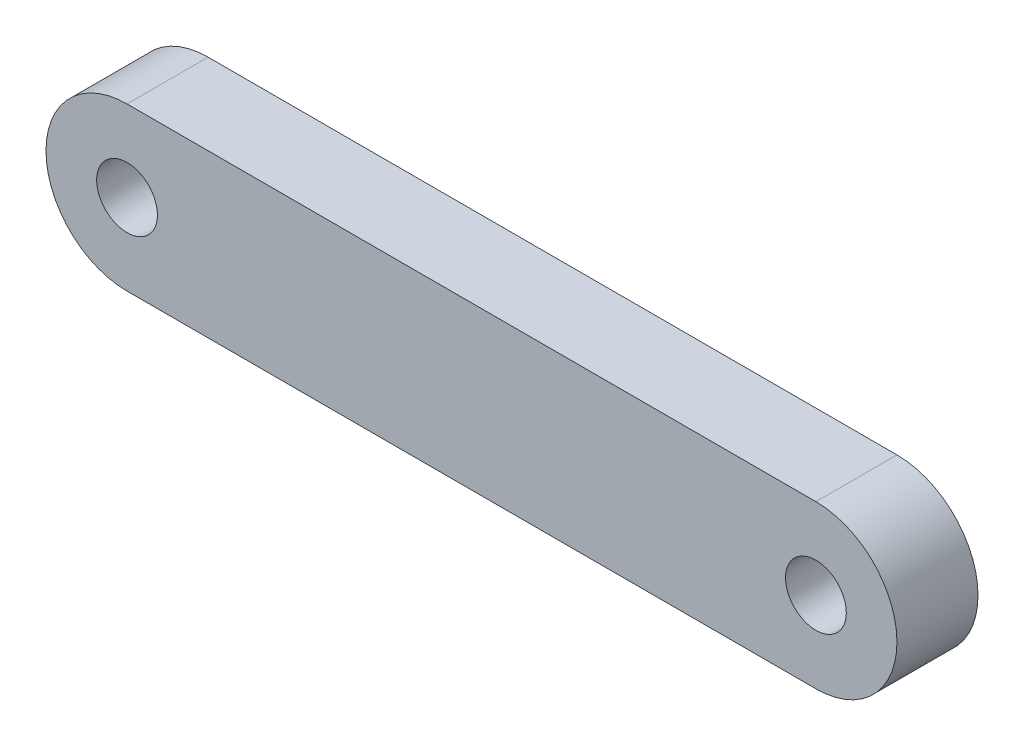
ISO-10303-21;
HEADER;
FILE_DESCRIPTION(('STEP AP214'),'2;1');
FILE_NAME('part.step','',(''),(''),'','','');
FILE_SCHEMA(('AUTOMOTIVE_DESIGN { 1 0 10303 214 1 1 1 1 }'));
ENDSEC;
DATA;
#1=APPLICATION_CONTEXT('core data for automotive mechanical design processes');
#2=APPLICATION_PROTOCOL_DEFINITION('international standard','automotive_design',2000,#1);
#3=PRODUCT_CONTEXT('',#1,'mechanical');
#4=PRODUCT('Part','Part','',(#3));
#5=PRODUCT_RELATED_PRODUCT_CATEGORY('part','',(#4));
#6=PRODUCT_DEFINITION_FORMATION('','',#4);
#7=PRODUCT_DEFINITION_CONTEXT('part definition',#1,'design');
#8=PRODUCT_DEFINITION('design','',#6,#7);
#9=PRODUCT_DEFINITION_SHAPE('','',#8);
#10=(LENGTH_UNIT() NAMED_UNIT(*) SI_UNIT(.MILLI.,.METRE.));
#11=(NAMED_UNIT(*) PLANE_ANGLE_UNIT() SI_UNIT($,.RADIAN.));
#12=(NAMED_UNIT(*) SI_UNIT($,.STERADIAN.) SOLID_ANGLE_UNIT());
#13=UNCERTAINTY_MEASURE_WITH_UNIT(LENGTH_MEASURE(1.E-05),#10,'distance_accuracy_value','');
#14=(GEOMETRIC_REPRESENTATION_CONTEXT(3) GLOBAL_UNCERTAINTY_ASSIGNED_CONTEXT((#13)) GLOBAL_UNIT_ASSIGNED_CONTEXT((#10,
#11,#12)) REPRESENTATION_CONTEXT('',''));
#15=CARTESIAN_POINT('',(0.,0.,0.));
#16=DIRECTION('',(0.,0.,1.));
#17=DIRECTION('',(1.,0.,0.));
#18=AXIS2_PLACEMENT_3D('',#15,#16,#17);
#19=CARTESIAN_POINT('',(0.,-4.,4.));
#20=DIRECTION('',(0.,1.,0.));
#21=DIRECTION('',(-1.,0.,0.));
#22=AXIS2_PLACEMENT_3D('',#19,#20,#21);
#23=PLANE('',#22);
#24=DIRECTION('',(1.,0.,0.));
#25=VECTOR('',#24,1.);
#26=CARTESIAN_POINT('',(0.,-4.,0.));
#27=LINE('',#26,#25);
#28=CARTESIAN_POINT('',(15.,-4.,0.));
#29=VERTEX_POINT('',#28);
#30=CARTESIAN_POINT('',(49.,-4.,0.));
#31=VERTEX_POINT('',#30);
#32=EDGE_CURVE('E104',#29,#31,#27,.T.);
#33=ORIENTED_EDGE('',*,*,#32,.T.);
#34=DIRECTION('',(0.,0.,-1.));
#35=VECTOR('',#34,1.);
#36=CARTESIAN_POINT('',(49.,-4.,4.));
#37=LINE('',#36,#35);
#38=CARTESIAN_POINT('',(49.,-4.,4.));
#39=VERTEX_POINT('',#38);
#40=EDGE_CURVE('E11',#39,#31,#37,.T.);
#41=ORIENTED_EDGE('',*,*,#40,.F.);
#42=DIRECTION('',(1.,0.,0.));
#43=VECTOR('',#42,1.);
#44=CARTESIAN_POINT('',(0.,-4.,4.));
#45=LINE('',#44,#43);
#46=CARTESIAN_POINT('',(15.,-4.,4.));
#47=VERTEX_POINT('',#46);
#48=EDGE_CURVE('E83',#47,#39,#45,.T.);
#49=ORIENTED_EDGE('',*,*,#48,.F.);
#50=DIRECTION('',(0.,0.,-1.));
#51=VECTOR('',#50,1.);
#52=CARTESIAN_POINT('',(15.,-4.,4.));
#53=LINE('',#52,#51);
#54=EDGE_CURVE('E94',#47,#29,#53,.T.);
#55=ORIENTED_EDGE('',*,*,#54,.T.);
#56=EDGE_LOOP('',(#33,#41,#49,#55));
#57=FACE_BOUND('',#56,.T.);
#58=ADVANCED_FACE('F35',(#57),#23,.F.);
#59=CARTESIAN_POINT('',(49.,0.,4.));
#60=DIRECTION('',(0.,0.,-1.));
#61=DIRECTION('',(-1.,0.,0.));
#62=AXIS2_PLACEMENT_3D('',#59,#60,#61);
#63=CYLINDRICAL_SURFACE('',#62,4.);
#64=CARTESIAN_POINT('',(49.,0.,0.));
#65=DIRECTION('',(0.,0.,1.));
#66=DIRECTION('',(1.,0.,0.));
#67=AXIS2_PLACEMENT_3D('',#64,#65,#66);
#68=CIRCLE('',#67,4.);
#69=CARTESIAN_POINT('',(49.,4.,0.));
#70=VERTEX_POINT('',#69);
#71=EDGE_CURVE('E88',#31,#70,#68,.T.);
#72=ORIENTED_EDGE('',*,*,#71,.T.);
#73=DIRECTION('',(0.,0.,-1.));
#74=VECTOR('',#73,1.);
#75=CARTESIAN_POINT('',(49.,4.,4.));
#76=LINE('',#75,#74);
#77=CARTESIAN_POINT('',(49.,4.,4.));
#78=VERTEX_POINT('',#77);
#79=EDGE_CURVE('E44',#78,#70,#76,.T.);
#80=ORIENTED_EDGE('',*,*,#79,.F.);
#81=CARTESIAN_POINT('',(49.,0.,4.));
#82=DIRECTION('',(0.,0.,1.));
#83=DIRECTION('',(1.,0.,0.));
#84=AXIS2_PLACEMENT_3D('',#81,#82,#83);
#85=CIRCLE('',#84,4.);
#86=EDGE_CURVE('E78',#39,#78,#85,.T.);
#87=ORIENTED_EDGE('',*,*,#86,.F.);
#88=ORIENTED_EDGE('',*,*,#40,.T.);
#89=EDGE_LOOP('',(#72,#80,#87,#88));
#90=FACE_BOUND('',#89,.T.);
#91=ADVANCED_FACE('F87',(#90),#63,.T.);
#92=CARTESIAN_POINT('',(0.,4.,4.));
#93=DIRECTION('',(0.,1.,0.));
#94=DIRECTION('',(-1.,0.,0.));
#95=AXIS2_PLACEMENT_3D('',#92,#93,#94);
#96=PLANE('',#95);
#97=DIRECTION('',(1.,0.,0.));
#98=VECTOR('',#97,1.);
#99=CARTESIAN_POINT('',(0.,4.,0.));
#100=LINE('',#99,#98);
#101=CARTESIAN_POINT('',(15.,4.,0.));
#102=VERTEX_POINT('',#101);
#103=EDGE_CURVE('E108',#102,#70,#100,.T.);
#104=ORIENTED_EDGE('',*,*,#103,.F.);
#105=DIRECTION('',(0.,0.,-1.));
#106=VECTOR('',#105,1.);
#107=CARTESIAN_POINT('',(15.,4.,4.));
#108=LINE('',#107,#106);
#109=CARTESIAN_POINT('',(15.,4.,4.));
#110=VERTEX_POINT('',#109);
#111=EDGE_CURVE('E68',#110,#102,#108,.T.);
#112=ORIENTED_EDGE('',*,*,#111,.F.);
#113=DIRECTION('',(1.,0.,0.));
#114=VECTOR('',#113,1.);
#115=CARTESIAN_POINT('',(0.,4.,4.));
#116=LINE('',#115,#114);
#117=EDGE_CURVE('E81',#110,#78,#116,.T.);
#118=ORIENTED_EDGE('',*,*,#117,.T.);
#119=ORIENTED_EDGE('',*,*,#79,.T.);
#120=EDGE_LOOP('',(#104,#112,#118,#119));
#121=FACE_BOUND('',#120,.T.);
#122=ADVANCED_FACE('F92',(#121),#96,.T.);
#123=CARTESIAN_POINT('',(15.,0.,4.));
#124=DIRECTION('',(0.,0.,-1.));
#125=DIRECTION('',(-1.,0.,0.));
#126=AXIS2_PLACEMENT_3D('',#123,#124,#125);
#127=CYLINDRICAL_SURFACE('',#126,1.5);
#128=CARTESIAN_POINT('',(15.,0.,4.));
#129=DIRECTION('',(0.,0.,1.));
#130=DIRECTION('',(1.,0.,0.));
#131=AXIS2_PLACEMENT_3D('',#128,#129,#130);
#132=CIRCLE('',#131,1.5);
#133=CARTESIAN_POINT('',(16.5,0.,4.));
#134=VERTEX_POINT('',#133);
#135=EDGE_CURVE('E146',#134,#134,#132,.T.);
#136=ORIENTED_EDGE('',*,*,#135,.T.);
#137=EDGE_LOOP('',(#136));
#138=FACE_BOUND('',#137,.T.);
#139=CARTESIAN_POINT('',(15.,0.,0.));
#140=DIRECTION('',(0.,0.,1.));
#141=DIRECTION('',(1.,0.,0.));
#142=AXIS2_PLACEMENT_3D('',#139,#140,#141);
#143=CIRCLE('',#142,1.5);
#144=CARTESIAN_POINT('',(16.5,0.,0.));
#145=VERTEX_POINT('',#144);
#146=EDGE_CURVE('E101',#145,#145,#143,.T.);
#147=ORIENTED_EDGE('',*,*,#146,.F.);
#148=EDGE_LOOP('',(#147));
#149=FACE_BOUND('',#148,.T.);
#150=ADVANCED_FACE('F135',(#138,#149),#127,.F.);
#151=CARTESIAN_POINT('',(49.,0.,4.));
#152=DIRECTION('',(0.,0.,-1.));
#153=DIRECTION('',(-1.,0.,0.));
#154=AXIS2_PLACEMENT_3D('',#151,#152,#153);
#155=CYLINDRICAL_SURFACE('',#154,1.5);
#156=CARTESIAN_POINT('',(49.,0.,4.));
#157=DIRECTION('',(0.,0.,1.));
#158=DIRECTION('',(1.,0.,0.));
#159=AXIS2_PLACEMENT_3D('',#156,#157,#158);
#160=CIRCLE('',#159,1.5);
#161=CARTESIAN_POINT('',(50.5,0.,4.));
#162=VERTEX_POINT('',#161);
#163=EDGE_CURVE('E111',#162,#162,#160,.T.);
#164=ORIENTED_EDGE('',*,*,#163,.T.);
#165=EDGE_LOOP('',(#164));
#166=FACE_BOUND('',#165,.T.);
#167=CARTESIAN_POINT('',(49.,0.,0.));
#168=DIRECTION('',(0.,0.,1.));
#169=DIRECTION('',(1.,0.,0.));
#170=AXIS2_PLACEMENT_3D('',#167,#168,#169);
#171=CIRCLE('',#170,1.5);
#172=CARTESIAN_POINT('',(50.5,0.,0.));
#173=VERTEX_POINT('',#172);
#174=EDGE_CURVE('E98',#173,#173,#171,.T.);
#175=ORIENTED_EDGE('',*,*,#174,.F.);
#176=EDGE_LOOP('',(#175));
#177=FACE_BOUND('',#176,.T.);
#178=ADVANCED_FACE('F37',(#166,#177),#155,.F.);
#179=CARTESIAN_POINT('',(15.,0.,4.));
#180=DIRECTION('',(0.,0.,-1.));
#181=DIRECTION('',(-1.,0.,0.));
#182=AXIS2_PLACEMENT_3D('',#179,#180,#181);
#183=CYLINDRICAL_SURFACE('',#182,4.);
#184=CARTESIAN_POINT('',(15.,0.,0.));
#185=DIRECTION('',(0.,0.,1.));
#186=DIRECTION('',(1.,0.,0.));
#187=AXIS2_PLACEMENT_3D('',#184,#185,#186);
#188=CIRCLE('',#187,4.);
#189=EDGE_CURVE('E71',#102,#29,#188,.T.);
#190=ORIENTED_EDGE('',*,*,#189,.T.);
#191=ORIENTED_EDGE('',*,*,#54,.F.);
#192=CARTESIAN_POINT('',(15.,0.,4.));
#193=DIRECTION('',(0.,0.,1.));
#194=DIRECTION('',(1.,0.,0.));
#195=AXIS2_PLACEMENT_3D('',#192,#193,#194);
#196=CIRCLE('',#195,4.);
#197=EDGE_CURVE('E52',#110,#47,#196,.T.);
#198=ORIENTED_EDGE('',*,*,#197,.F.);
#199=ORIENTED_EDGE('',*,*,#111,.T.);
#200=EDGE_LOOP('',(#190,#191,#198,#199));
#201=FACE_BOUND('',#200,.T.);
#202=ADVANCED_FACE('F123',(#201),#183,.T.);
#203=CARTESIAN_POINT('',(0.,0.,4.));
#204=DIRECTION('',(0.,0.,1.));
#205=DIRECTION('',(1.,0.,0.));
#206=AXIS2_PLACEMENT_3D('',#203,#204,#205);
#207=PLANE('',#206);
#208=ORIENTED_EDGE('',*,*,#163,.F.);
#209=EDGE_LOOP('',(#208));
#210=FACE_BOUND('',#209,.T.);
#211=ORIENTED_EDGE('',*,*,#135,.F.);
#212=EDGE_LOOP('',(#211));
#213=FACE_BOUND('',#212,.T.);
#214=ORIENTED_EDGE('',*,*,#48,.T.);
#215=ORIENTED_EDGE('',*,*,#86,.T.);
#216=ORIENTED_EDGE('',*,*,#117,.F.);
#217=ORIENTED_EDGE('',*,*,#197,.T.);
#218=EDGE_LOOP('',(#214,#215,#216,#217));
#219=FACE_BOUND('',#218,.T.);
#220=ADVANCED_FACE('F79',(#210,#213,#219),#207,.T.);
#221=CARTESIAN_POINT('',(0.,0.,0.));
#222=DIRECTION('',(0.,0.,1.));
#223=DIRECTION('',(1.,0.,0.));
#224=AXIS2_PLACEMENT_3D('',#221,#222,#223);
#225=PLANE('',#224);
#226=ORIENTED_EDGE('',*,*,#174,.T.);
#227=EDGE_LOOP('',(#226));
#228=FACE_BOUND('',#227,.T.);
#229=ORIENTED_EDGE('',*,*,#146,.T.);
#230=EDGE_LOOP('',(#229));
#231=FACE_BOUND('',#230,.T.);
#232=ORIENTED_EDGE('',*,*,#32,.F.);
#233=ORIENTED_EDGE('',*,*,#189,.F.);
#234=ORIENTED_EDGE('',*,*,#103,.T.);
#235=ORIENTED_EDGE('',*,*,#71,.F.);
#236=EDGE_LOOP('',(#232,#233,#234,#235));
#237=FACE_BOUND('',#236,.T.);
#238=ADVANCED_FACE('F116',(#228,#231,#237),#225,.F.);
#239=CLOSED_SHELL('',(#58,#91,#122,#150,#178,#202,#220,#238));
#240=MANIFOLD_SOLID_BREP('B2',#239);
#241=ADVANCED_BREP_SHAPE_REPRESENTATION('',(#18,#240),#14);
#242=SHAPE_DEFINITION_REPRESENTATION(#9,#241);
ENDSEC;
END-ISO-10303-21;
